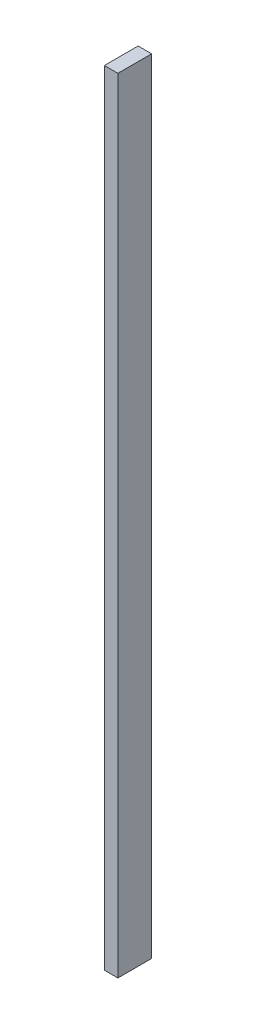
ISO-10303-21;
HEADER;
FILE_DESCRIPTION(('STEP AP214'),'2;1');
FILE_NAME('part.step','',(''),(''),'','','');
FILE_SCHEMA(('AUTOMOTIVE_DESIGN { 1 0 10303 214 1 1 1 1 }'));
ENDSEC;
DATA;
#1=APPLICATION_CONTEXT('core data for automotive mechanical design processes');
#2=APPLICATION_PROTOCOL_DEFINITION('international standard','automotive_design',2000,#1);
#3=PRODUCT_CONTEXT('',#1,'mechanical');
#4=PRODUCT('Part','Part','',(#3));
#5=PRODUCT_RELATED_PRODUCT_CATEGORY('part','',(#4));
#6=PRODUCT_DEFINITION_FORMATION('','',#4);
#7=PRODUCT_DEFINITION_CONTEXT('part definition',#1,'design');
#8=PRODUCT_DEFINITION('design','',#6,#7);
#9=PRODUCT_DEFINITION_SHAPE('','',#8);
#10=(LENGTH_UNIT() NAMED_UNIT(*) SI_UNIT(.MILLI.,.METRE.));
#11=(NAMED_UNIT(*) PLANE_ANGLE_UNIT() SI_UNIT($,.RADIAN.));
#12=(NAMED_UNIT(*) SI_UNIT($,.STERADIAN.) SOLID_ANGLE_UNIT());
#13=UNCERTAINTY_MEASURE_WITH_UNIT(LENGTH_MEASURE(1.E-05),#10,'distance_accuracy_value','');
#14=(GEOMETRIC_REPRESENTATION_CONTEXT(3) GLOBAL_UNCERTAINTY_ASSIGNED_CONTEXT((#13)) GLOBAL_UNIT_ASSIGNED_CONTEXT((#10,
#11,#12)) REPRESENTATION_CONTEXT('',''));
#15=CARTESIAN_POINT('',(0.,0.,0.));
#16=DIRECTION('',(0.,0.,1.));
#17=DIRECTION('',(1.,0.,0.));
#18=AXIS2_PLACEMENT_3D('',#15,#16,#17);
#19=CARTESIAN_POINT('',(0.,1160.,0.));
#20=DIRECTION('',(1.,0.,0.));
#21=DIRECTION('',(0.,0.,-1.));
#22=AXIS2_PLACEMENT_3D('',#19,#20,#21);
#23=PLANE('',#22);
#24=DIRECTION('',(0.,0.,1.));
#25=VECTOR('',#24,1.);
#26=CARTESIAN_POINT('',(0.,0.,0.));
#27=LINE('',#26,#25);
#28=CARTESIAN_POINT('',(0.,0.,-50.));
#29=VERTEX_POINT('',#28);
#30=CARTESIAN_POINT('',(0.,0.,0.));
#31=VERTEX_POINT('',#30);
#32=EDGE_CURVE('E95',#29,#31,#27,.T.);
#33=ORIENTED_EDGE('',*,*,#32,.T.);
#34=DIRECTION('',(0.,-1.,0.));
#35=VECTOR('',#34,1.);
#36=CARTESIAN_POINT('',(0.,1160.,0.));
#37=LINE('',#36,#35);
#38=CARTESIAN_POINT('',(0.,1160.,0.));
#39=VERTEX_POINT('',#38);
#40=EDGE_CURVE('E11',#39,#31,#37,.T.);
#41=ORIENTED_EDGE('',*,*,#40,.F.);
#42=DIRECTION('',(0.,0.,1.));
#43=VECTOR('',#42,1.);
#44=CARTESIAN_POINT('',(0.,1160.,0.));
#45=LINE('',#44,#43);
#46=CARTESIAN_POINT('',(0.,1160.,-50.));
#47=VERTEX_POINT('',#46);
#48=EDGE_CURVE('E83',#47,#39,#45,.T.);
#49=ORIENTED_EDGE('',*,*,#48,.F.);
#50=DIRECTION('',(0.,-1.,0.));
#51=VECTOR('',#50,1.);
#52=CARTESIAN_POINT('',(0.,1160.,-50.));
#53=LINE('',#52,#51);
#54=EDGE_CURVE('E91',#47,#29,#53,.T.);
#55=ORIENTED_EDGE('',*,*,#54,.T.);
#56=EDGE_LOOP('',(#33,#41,#49,#55));
#57=FACE_BOUND('',#56,.T.);
#58=ADVANCED_FACE('F32',(#57),#23,.F.);
#59=CARTESIAN_POINT('',(0.,1160.,0.));
#60=DIRECTION('',(0.,0.,-1.));
#61=DIRECTION('',(-1.,0.,0.));
#62=AXIS2_PLACEMENT_3D('',#59,#60,#61);
#63=PLANE('',#62);
#64=DIRECTION('',(1.,0.,0.));
#65=VECTOR('',#64,1.);
#66=CARTESIAN_POINT('',(0.,0.,0.));
#67=LINE('',#66,#65);
#68=CARTESIAN_POINT('',(20.,0.,0.));
#69=VERTEX_POINT('',#68);
#70=EDGE_CURVE('E87',#31,#69,#67,.T.);
#71=ORIENTED_EDGE('',*,*,#70,.T.);
#72=DIRECTION('',(0.,-1.,0.));
#73=VECTOR('',#72,1.);
#74=CARTESIAN_POINT('',(20.,1160.,0.));
#75=LINE('',#74,#73);
#76=CARTESIAN_POINT('',(20.,1160.,0.));
#77=VERTEX_POINT('',#76);
#78=EDGE_CURVE('E40',#77,#69,#75,.T.);
#79=ORIENTED_EDGE('',*,*,#78,.F.);
#80=DIRECTION('',(1.,0.,0.));
#81=VECTOR('',#80,1.);
#82=CARTESIAN_POINT('',(0.,1160.,0.));
#83=LINE('',#82,#81);
#84=EDGE_CURVE('E78',#39,#77,#83,.T.);
#85=ORIENTED_EDGE('',*,*,#84,.F.);
#86=ORIENTED_EDGE('',*,*,#40,.T.);
#87=EDGE_LOOP('',(#71,#79,#85,#86));
#88=FACE_BOUND('',#87,.T.);
#89=ADVANCED_FACE('F86',(#88),#63,.F.);
#90=CARTESIAN_POINT('',(20.,1160.,0.));
#91=DIRECTION('',(-1.,0.,0.));
#92=DIRECTION('',(0.,0.,1.));
#93=AXIS2_PLACEMENT_3D('',#90,#91,#92);
#94=PLANE('',#93);
#95=DIRECTION('',(0.,0.,-1.));
#96=VECTOR('',#95,1.);
#97=CARTESIAN_POINT('',(20.,0.,0.));
#98=LINE('',#97,#96);
#99=CARTESIAN_POINT('',(20.,0.,-50.));
#100=VERTEX_POINT('',#99);
#101=EDGE_CURVE('E65',#69,#100,#98,.T.);
#102=ORIENTED_EDGE('',*,*,#101,.T.);
#103=DIRECTION('',(0.,-1.,0.));
#104=VECTOR('',#103,1.);
#105=CARTESIAN_POINT('',(20.,1160.,-50.));
#106=LINE('',#105,#104);
#107=CARTESIAN_POINT('',(20.,1160.,-50.));
#108=VERTEX_POINT('',#107);
#109=EDGE_CURVE('E88',#108,#100,#106,.T.);
#110=ORIENTED_EDGE('',*,*,#109,.F.);
#111=DIRECTION('',(0.,0.,-1.));
#112=VECTOR('',#111,1.);
#113=CARTESIAN_POINT('',(20.,1160.,0.));
#114=LINE('',#113,#112);
#115=EDGE_CURVE('E81',#77,#108,#114,.T.);
#116=ORIENTED_EDGE('',*,*,#115,.F.);
#117=ORIENTED_EDGE('',*,*,#78,.T.);
#118=EDGE_LOOP('',(#102,#110,#116,#117));
#119=FACE_BOUND('',#118,.T.);
#120=ADVANCED_FACE('F89',(#119),#94,.F.);
#121=CARTESIAN_POINT('',(0.,1160.,-50.));
#122=DIRECTION('',(0.,0.,1.));
#123=DIRECTION('',(1.,0.,0.));
#124=AXIS2_PLACEMENT_3D('',#121,#122,#123);
#125=PLANE('',#124);
#126=DIRECTION('',(-1.,0.,0.));
#127=VECTOR('',#126,1.);
#128=CARTESIAN_POINT('',(0.,0.,-50.));
#129=LINE('',#128,#127);
#130=EDGE_CURVE('E71',#100,#29,#129,.T.);
#131=ORIENTED_EDGE('',*,*,#130,.T.);
#132=ORIENTED_EDGE('',*,*,#54,.F.);
#133=DIRECTION('',(-1.,0.,0.));
#134=VECTOR('',#133,1.);
#135=CARTESIAN_POINT('',(0.,1160.,-50.));
#136=LINE('',#135,#134);
#137=EDGE_CURVE('E48',#108,#47,#136,.T.);
#138=ORIENTED_EDGE('',*,*,#137,.F.);
#139=ORIENTED_EDGE('',*,*,#109,.T.);
#140=EDGE_LOOP('',(#131,#132,#138,#139));
#141=FACE_BOUND('',#140,.T.);
#142=ADVANCED_FACE('F102',(#141),#125,.F.);
#143=CARTESIAN_POINT('',(0.,1160.,-50.));
#144=DIRECTION('',(0.,-1.,0.));
#145=DIRECTION('',(0.,0.,-1.));
#146=AXIS2_PLACEMENT_3D('',#143,#144,#145);
#147=PLANE('',#146);
#148=ORIENTED_EDGE('',*,*,#48,.T.);
#149=ORIENTED_EDGE('',*,*,#84,.T.);
#150=ORIENTED_EDGE('',*,*,#115,.T.);
#151=ORIENTED_EDGE('',*,*,#137,.T.);
#152=EDGE_LOOP('',(#148,#149,#150,#151));
#153=FACE_BOUND('',#152,.T.);
#154=ADVANCED_FACE('F79',(#153),#147,.F.);
#155=CARTESIAN_POINT('',(0.,0.,-50.));
#156=DIRECTION('',(0.,-1.,0.));
#157=DIRECTION('',(0.,0.,-1.));
#158=AXIS2_PLACEMENT_3D('',#155,#156,#157);
#159=PLANE('',#158);
#160=ORIENTED_EDGE('',*,*,#32,.F.);
#161=ORIENTED_EDGE('',*,*,#130,.F.);
#162=ORIENTED_EDGE('',*,*,#101,.F.);
#163=ORIENTED_EDGE('',*,*,#70,.F.);
#164=EDGE_LOOP('',(#160,#161,#162,#163));
#165=FACE_BOUND('',#164,.T.);
#166=ADVANCED_FACE('F105',(#165),#159,.T.);
#167=CLOSED_SHELL('',(#58,#89,#120,#142,#154,#166));
#168=MANIFOLD_SOLID_BREP('B2',#167);
#169=ADVANCED_BREP_SHAPE_REPRESENTATION('',(#18,#168),#14);
#170=SHAPE_DEFINITION_REPRESENTATION(#9,#169);
ENDSEC;
END-ISO-10303-21;
